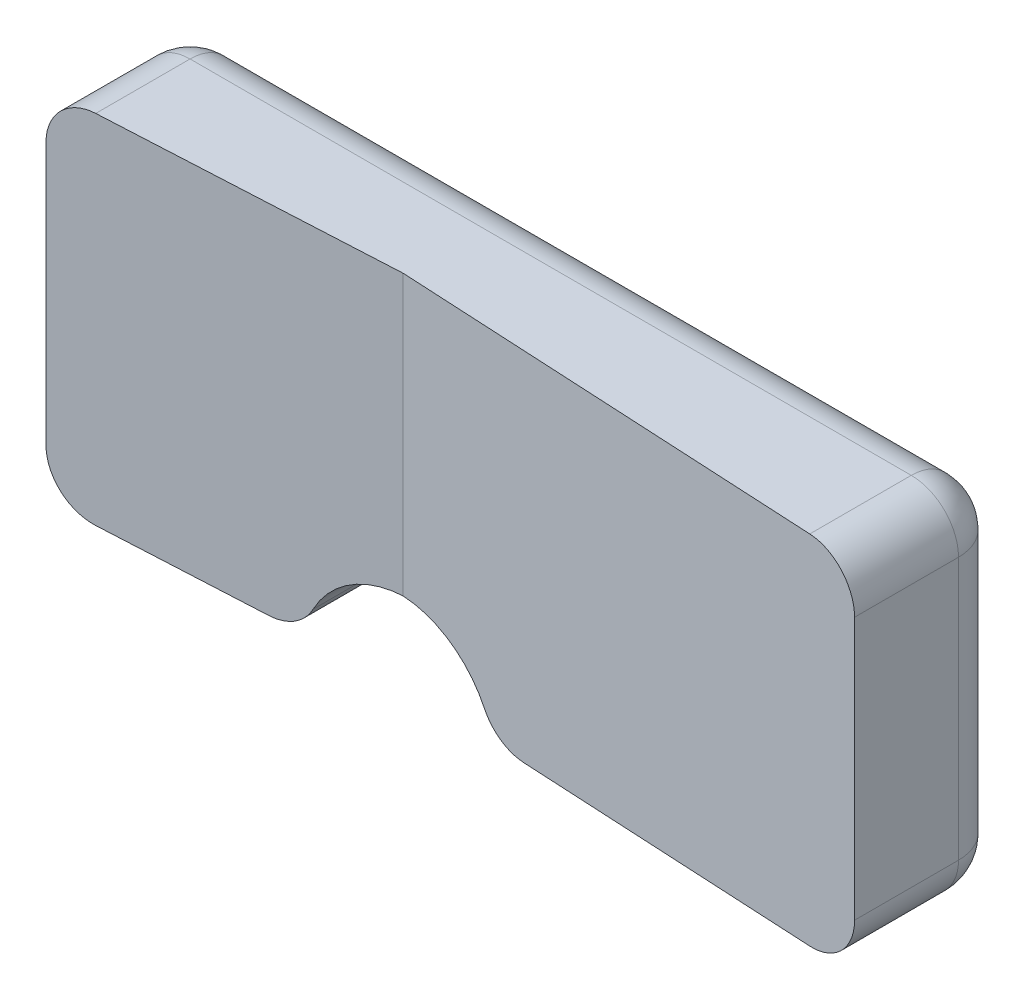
ISO-10303-21;
HEADER;
FILE_DESCRIPTION(('STEP AP214'),'2;1');
FILE_NAME('part.step','',(''),(''),'','','');
FILE_SCHEMA(('AUTOMOTIVE_DESIGN { 1 0 10303 214 1 1 1 1 }'));
ENDSEC;
DATA;
#1=APPLICATION_CONTEXT('core data for automotive mechanical design processes');
#2=APPLICATION_PROTOCOL_DEFINITION('international standard','automotive_design',2000,#1);
#3=PRODUCT_CONTEXT('',#1,'mechanical');
#4=PRODUCT('Part','Part','',(#3));
#5=PRODUCT_RELATED_PRODUCT_CATEGORY('part','',(#4));
#6=PRODUCT_DEFINITION_FORMATION('','',#4);
#7=PRODUCT_DEFINITION_CONTEXT('part definition',#1,'design');
#8=PRODUCT_DEFINITION('design','',#6,#7);
#9=PRODUCT_DEFINITION_SHAPE('','',#8);
#10=(LENGTH_UNIT() NAMED_UNIT(*) SI_UNIT(.MILLI.,.METRE.));
#11=(NAMED_UNIT(*) PLANE_ANGLE_UNIT() SI_UNIT($,.RADIAN.));
#12=(NAMED_UNIT(*) SI_UNIT($,.STERADIAN.) SOLID_ANGLE_UNIT());
#13=UNCERTAINTY_MEASURE_WITH_UNIT(LENGTH_MEASURE(1.E-05),#10,'distance_accuracy_value','');
#14=(GEOMETRIC_REPRESENTATION_CONTEXT(3) GLOBAL_UNCERTAINTY_ASSIGNED_CONTEXT((#13)) GLOBAL_UNIT_ASSIGNED_CONTEXT((#10,
#11,#12)) REPRESENTATION_CONTEXT('',''));
#15=CARTESIAN_POINT('',(0.,0.,0.));
#16=DIRECTION('',(0.,0.,1.));
#17=DIRECTION('',(1.,0.,0.));
#18=AXIS2_PLACEMENT_3D('',#15,#16,#17);
#19=CARTESIAN_POINT('',(-57.,-34.544,19.05));
#20=DIRECTION('',(0.,1.,0.));
#21=DIRECTION('',(0.,0.,1.));
#22=AXIS2_PLACEMENT_3D('',#19,#20,#21);
#23=PLANE('',#22);
#24=DIRECTION('',(-0.998629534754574,0.,-0.0523359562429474));
#25=VECTOR('',#24,1.);
#26=CARTESIAN_POINT('',(-56.4339853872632,-34.544,8.24979780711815));
#27=LINE('',#26,#25);
#28=CARTESIAN_POINT('',(72.0625,-34.544,14.9840132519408));
#29=VERTEX_POINT('',#28);
#30=CARTESIAN_POINT('',(21.4100107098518,-34.544,12.329428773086));
#31=VERTEX_POINT('',#30);
#32=EDGE_CURVE('E174',#29,#31,#27,.T.);
#33=ORIENTED_EDGE('',*,*,#32,.T.);
#34=DIRECTION('',(0.,0.,-1.));
#35=VECTOR('',#34,1.);
#36=CARTESIAN_POINT('',(21.4100107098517,-34.544,19.05));
#37=LINE('',#36,#35);
#38=CARTESIAN_POINT('',(21.4100107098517,-34.544,-2.0625));
#39=VERTEX_POINT('',#38);
#40=EDGE_CURVE('E218',#31,#39,#37,.T.);
#41=ORIENTED_EDGE('',*,*,#40,.T.);
#42=DIRECTION('',(1.,0.,0.));
#43=VECTOR('',#42,1.);
#44=CARTESIAN_POINT('',(-57.,-34.544,-2.0625));
#45=LINE('',#44,#43);
#46=CARTESIAN_POINT('',(72.0625,-34.544,-2.0625));
#47=VERTEX_POINT('',#46);
#48=EDGE_CURVE('E216',#39,#47,#45,.T.);
#49=ORIENTED_EDGE('',*,*,#48,.T.);
#50=DIRECTION('',(0.,0.,-1.));
#51=VECTOR('',#50,1.);
#52=CARTESIAN_POINT('',(72.0625,-34.544,19.05));
#53=LINE('',#52,#51);
#54=EDGE_CURVE('E214',#47,#29,#53,.F.);
#55=ORIENTED_EDGE('',*,*,#54,.T.);
#56=EDGE_LOOP('',(#33,#41,#49,#55));
#57=FACE_BOUND('',#56,.T.);
#58=ADVANCED_FACE('F34',(#57),#23,.F.);
#59=CARTESIAN_POINT('',(-57.,25.4,19.05));
#60=DIRECTION('',(1.,0.,0.));
#61=DIRECTION('',(0.,1.,0.));
#62=AXIS2_PLACEMENT_3D('',#59,#60,#61);
#63=PLANE('',#62);
#64=DIRECTION('',(0.,-1.,0.));
#65=VECTOR('',#64,1.);
#66=CARTESIAN_POINT('',(-57.,25.4,-2.0625));
#67=LINE('',#66,#65);
#68=CARTESIAN_POINT('',(-57.,17.4625,-2.0625));
#69=VERTEX_POINT('',#68);
#70=CARTESIAN_POINT('',(-57.,-26.6065,-2.0625));
#71=VERTEX_POINT('',#70);
#72=EDGE_CURVE('E228',#69,#71,#67,.T.);
#73=ORIENTED_EDGE('',*,*,#72,.T.);
#74=DIRECTION('',(0.,0.,-1.));
#75=VECTOR('',#74,1.);
#76=CARTESIAN_POINT('',(-57.,-26.6065,19.05));
#77=LINE('',#76,#75);
#78=CARTESIAN_POINT('',(-57.,-26.6065,14.1946210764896));
#79=VERTEX_POINT('',#78);
#80=EDGE_CURVE('E230',#71,#79,#77,.F.);
#81=ORIENTED_EDGE('',*,*,#80,.T.);
#82=DIRECTION('',(0.,1.,0.));
#83=VECTOR('',#82,1.);
#84=CARTESIAN_POINT('',(-57.,-83.058,14.1946210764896));
#85=LINE('',#84,#83);
#86=CARTESIAN_POINT('',(-57.,17.4625,14.1946210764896));
#87=VERTEX_POINT('',#86);
#88=EDGE_CURVE('E170',#79,#87,#85,.T.);
#89=ORIENTED_EDGE('',*,*,#88,.T.);
#90=DIRECTION('',(0.,0.,-1.));
#91=VECTOR('',#90,1.);
#92=CARTESIAN_POINT('',(-57.,17.4625,19.05));
#93=LINE('',#92,#91);
#94=EDGE_CURVE('E226',#87,#69,#93,.T.);
#95=ORIENTED_EDGE('',*,*,#94,.T.);
#96=EDGE_LOOP('',(#73,#81,#89,#95));
#97=FACE_BOUND('',#96,.T.);
#98=ADVANCED_FACE('F36',(#97),#63,.F.);
#99=DIRECTION('',(1.,0.,0.));
#100=VECTOR('',#99,1.);
#101=CARTESIAN_POINT('',(-57.,-34.544,-2.0625));
#102=LINE('',#101,#100);
#103=CARTESIAN_POINT('',(-49.0625,-34.544,-2.0625));
#104=VERTEX_POINT('',#103);
#105=CARTESIAN_POINT('',(-21.4100107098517,-34.544,-2.0625));
#106=VERTEX_POINT('',#105);
#107=EDGE_CURVE('E190',#104,#106,#102,.T.);
#108=ORIENTED_EDGE('',*,*,#107,.T.);
#109=DIRECTION('',(0.,0.,-1.));
#110=VECTOR('',#109,1.);
#111=CARTESIAN_POINT('',(-21.4100107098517,-34.544,19.05));
#112=LINE('',#111,#110);
#113=CARTESIAN_POINT('',(-21.4100107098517,-34.544,12.3294287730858));
#114=VERTEX_POINT('',#113);
#115=EDGE_CURVE('E194',#106,#114,#112,.F.);
#116=ORIENTED_EDGE('',*,*,#115,.T.);
#117=DIRECTION('',(-0.998629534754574,0.,0.0523359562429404));
#118=VECTOR('',#117,1.);
#119=CARTESIAN_POINT('',(-57.2537626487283,-34.544,14.2079202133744));
#120=LINE('',#119,#118);
#121=CARTESIAN_POINT('',(-49.0625,-34.544,13.7786343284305));
#122=VERTEX_POINT('',#121);
#123=EDGE_CURVE('E166',#114,#122,#120,.T.);
#124=ORIENTED_EDGE('',*,*,#123,.T.);
#125=DIRECTION('',(0.,0.,-1.));
#126=VECTOR('',#125,1.);
#127=CARTESIAN_POINT('',(-49.0625,-34.544,19.05));
#128=LINE('',#127,#126);
#129=EDGE_CURVE('E192',#122,#104,#128,.T.);
#130=ORIENTED_EDGE('',*,*,#129,.T.);
#131=EDGE_LOOP('',(#108,#116,#124,#130));
#132=FACE_BOUND('',#131,.T.);
#133=ADVANCED_FACE('F376',(#132),#23,.F.);
#134=CARTESIAN_POINT('',(80.,25.4,19.05));
#135=DIRECTION('',(-1.,0.,0.));
#136=DIRECTION('',(0.,-1.,0.));
#137=AXIS2_PLACEMENT_3D('',#134,#135,#136);
#138=PLANE('',#137);
#139=DIRECTION('',(0.,1.,0.));
#140=VECTOR('',#139,1.);
#141=CARTESIAN_POINT('',(80.,-83.058,15.4));
#142=LINE('',#141,#140);
#143=CARTESIAN_POINT('',(80.,-26.6065,15.4));
#144=VERTEX_POINT('',#143);
#145=CARTESIAN_POINT('',(80.,17.4625,15.4));
#146=VERTEX_POINT('',#145);
#147=EDGE_CURVE('E171',#144,#146,#142,.T.);
#148=ORIENTED_EDGE('',*,*,#147,.F.);
#149=DIRECTION('',(0.,0.,-1.));
#150=VECTOR('',#149,1.);
#151=CARTESIAN_POINT('',(80.,-26.6065,19.05));
#152=LINE('',#151,#150);
#153=CARTESIAN_POINT('',(80.,-26.6065,-2.0625));
#154=VERTEX_POINT('',#153);
#155=EDGE_CURVE('E11',#144,#154,#152,.T.);
#156=ORIENTED_EDGE('',*,*,#155,.T.);
#157=DIRECTION('',(0.,1.,0.));
#158=VECTOR('',#157,1.);
#159=CARTESIAN_POINT('',(80.,25.4,-2.0625));
#160=LINE('',#159,#158);
#161=CARTESIAN_POINT('',(80.,17.4625,-2.0625));
#162=VERTEX_POINT('',#161);
#163=EDGE_CURVE('E42',#154,#162,#160,.T.);
#164=ORIENTED_EDGE('',*,*,#163,.T.);
#165=DIRECTION('',(0.,0.,-1.));
#166=VECTOR('',#165,1.);
#167=CARTESIAN_POINT('',(80.,17.4625,19.05));
#168=LINE('',#167,#166);
#169=EDGE_CURVE('E238',#162,#146,#168,.F.);
#170=ORIENTED_EDGE('',*,*,#169,.T.);
#171=EDGE_LOOP('',(#148,#156,#164,#170));
#172=FACE_BOUND('',#171,.T.);
#173=ADVANCED_FACE('F239',(#172),#138,.F.);
#174=CARTESIAN_POINT('',(-57.,25.4,19.05));
#175=DIRECTION('',(0.,-1.,0.));
#176=DIRECTION('',(0.,0.,-1.));
#177=AXIS2_PLACEMENT_3D('',#174,#175,#176);
#178=PLANE('',#177);
#179=DIRECTION('',(-1.,0.,0.));
#180=VECTOR('',#179,1.);
#181=CARTESIAN_POINT('',(-57.,25.4,-2.0625));
#182=LINE('',#181,#180);
#183=CARTESIAN_POINT('',(72.0625,25.4,-2.0625));
#184=VERTEX_POINT('',#183);
#185=CARTESIAN_POINT('',(-49.0625,25.4,-2.0625));
#186=VERTEX_POINT('',#185);
#187=EDGE_CURVE('E234',#184,#186,#182,.T.);
#188=ORIENTED_EDGE('',*,*,#187,.T.);
#189=DIRECTION('',(0.,0.,-1.));
#190=VECTOR('',#189,1.);
#191=CARTESIAN_POINT('',(-49.0625,25.4,19.05));
#192=LINE('',#191,#190);
#193=CARTESIAN_POINT('',(-49.0625,25.4,13.7786343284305));
#194=VERTEX_POINT('',#193);
#195=EDGE_CURVE('E236',#186,#194,#192,.F.);
#196=ORIENTED_EDGE('',*,*,#195,.T.);
#197=DIRECTION('',(-0.998629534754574,0.,0.0523359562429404));
#198=VECTOR('',#197,1.);
#199=CARTESIAN_POINT('',(0.,25.4,11.2073776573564));
#200=LINE('',#199,#198);
#201=CARTESIAN_POINT('',(0.,25.4,11.2073776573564));
#202=VERTEX_POINT('',#201);
#203=EDGE_CURVE('E177',#202,#194,#200,.T.);
#204=ORIENTED_EDGE('',*,*,#203,.F.);
#205=DIRECTION('',(-0.998629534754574,0.,-0.0523359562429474));
#206=VECTOR('',#205,1.);
#207=CARTESIAN_POINT('',(80.,25.4,15.4));
#208=LINE('',#207,#206);
#209=CARTESIAN_POINT('',(72.0625,25.4,14.9840132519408));
#210=VERTEX_POINT('',#209);
#211=EDGE_CURVE('E156',#210,#202,#208,.T.);
#212=ORIENTED_EDGE('',*,*,#211,.F.);
#213=DIRECTION('',(0.,0.,-1.));
#214=VECTOR('',#213,1.);
#215=CARTESIAN_POINT('',(72.0625,25.4,19.05));
#216=LINE('',#215,#214);
#217=EDGE_CURVE('E232',#210,#184,#216,.T.);
#218=ORIENTED_EDGE('',*,*,#217,.T.);
#219=EDGE_LOOP('',(#188,#196,#204,#212,#218));
#220=FACE_BOUND('',#219,.T.);
#221=ADVANCED_FACE('F250',(#220),#178,.F.);
#222=CARTESIAN_POINT('',(-57.,-34.544,-10.));
#223=DIRECTION('',(0.,0.,1.));
#224=DIRECTION('',(1.,0.,0.));
#225=AXIS2_PLACEMENT_3D('',#222,#223,#224);
#226=PLANE('',#225);
#227=DIRECTION('',(1.,0.,0.));
#228=VECTOR('',#227,1.);
#229=CARTESIAN_POINT('',(-57.,-26.6065,-10.));
#230=LINE('',#229,#228);
#231=CARTESIAN_POINT('',(72.0625,-26.6065,-10.));
#232=VERTEX_POINT('',#231);
#233=CARTESIAN_POINT('',(21.4100107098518,-26.6065,-10.));
#234=VERTEX_POINT('',#233);
#235=EDGE_CURVE('E203',#232,#234,#230,.F.);
#236=ORIENTED_EDGE('',*,*,#235,.T.);
#237=CARTESIAN_POINT('',(0.,-37.7370707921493,-10.));
#238=DIRECTION('',(0.,0.,1.));
#239=DIRECTION('',(1.,0.,0.));
#240=AXIS2_PLACEMENT_3D('',#237,#238,#239);
#241=CIRCLE('',#240,24.1304406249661);
#242=CARTESIAN_POINT('',(-21.4100107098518,-26.6065,-10.));
#243=VERTEX_POINT('',#242);
#244=EDGE_CURVE('E211',#234,#243,#241,.T.);
#245=ORIENTED_EDGE('',*,*,#244,.T.);
#246=DIRECTION('',(1.,0.,0.));
#247=VECTOR('',#246,1.);
#248=CARTESIAN_POINT('',(-57.,-26.6065,-10.));
#249=LINE('',#248,#247);
#250=CARTESIAN_POINT('',(-49.0625,-26.6065,-10.));
#251=VERTEX_POINT('',#250);
#252=EDGE_CURVE('E209',#243,#251,#249,.F.);
#253=ORIENTED_EDGE('',*,*,#252,.T.);
#254=DIRECTION('',(0.,-1.,0.));
#255=VECTOR('',#254,1.);
#256=CARTESIAN_POINT('',(-49.0625,-34.544,-10.));
#257=LINE('',#256,#255);
#258=CARTESIAN_POINT('',(-49.0625,17.4625,-10.));
#259=VERTEX_POINT('',#258);
#260=EDGE_CURVE('E207',#251,#259,#257,.F.);
#261=ORIENTED_EDGE('',*,*,#260,.T.);
#262=DIRECTION('',(-1.,0.,0.));
#263=VECTOR('',#262,1.);
#264=CARTESIAN_POINT('',(-57.,17.4625,-10.));
#265=LINE('',#264,#263);
#266=CARTESIAN_POINT('',(72.0625,17.4625,-10.));
#267=VERTEX_POINT('',#266);
#268=EDGE_CURVE('E205',#259,#267,#265,.F.);
#269=ORIENTED_EDGE('',*,*,#268,.T.);
#270=DIRECTION('',(0.,1.,0.));
#271=VECTOR('',#270,1.);
#272=CARTESIAN_POINT('',(72.0625,-34.5440000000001,-10.));
#273=LINE('',#272,#271);
#274=EDGE_CURVE('E201',#267,#232,#273,.F.);
#275=ORIENTED_EDGE('',*,*,#274,.T.);
#276=EDGE_LOOP('',(#236,#245,#253,#261,#269,#275));
#277=FACE_BOUND('',#276,.T.);
#278=ADVANCED_FACE('F409',(#277),#226,.F.);
#279=CARTESIAN_POINT('',(0.,-83.058,11.2073776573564));
#280=DIRECTION('',(-0.0523359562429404,0.,-0.998629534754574));
#281=DIRECTION('',(-0.998629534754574,0.,0.0523359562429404));
#282=AXIS2_PLACEMENT_3D('',#279,#280,#281);
#283=PLANE('',#282);
#284=ORIENTED_EDGE('',*,*,#123,.F.);
#285=CARTESIAN_POINT('',(-21.4100107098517,-26.6065,12.3294287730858));
#286=DIRECTION('',(-0.0523359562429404,0.,-0.998629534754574));
#287=DIRECTION('',(0.998629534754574,0.,-0.0523359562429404));
#288=AXIS2_PLACEMENT_3D('',#285,#286,#287);
#289=ELLIPSE('',#288,7.9483929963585,7.9375);
#290=CARTESIAN_POINT('',(-14.3673726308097,-30.2678051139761,11.960339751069));
#291=VERTEX_POINT('',#290);
#292=EDGE_CURVE('E152',#114,#291,#289,.F.);
#293=ORIENTED_EDGE('',*,*,#292,.T.);
#294=CARTESIAN_POINT('',(0.,-37.7370707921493,11.2073776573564));
#295=DIRECTION('',(-0.0523359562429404,0.,-0.998629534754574));
#296=DIRECTION('',(0.998629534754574,0.,-0.0523359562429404));
#297=AXIS2_PLACEMENT_3D('',#294,#295,#296);
#298=ELLIPSE('',#297,16.2151629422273,16.1929406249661);
#299=CARTESIAN_POINT('',(0.,-21.5441301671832,11.2073776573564));
#300=VERTEX_POINT('',#299);
#301=EDGE_CURVE('E143',#291,#300,#298,.T.);
#302=ORIENTED_EDGE('',*,*,#301,.T.);
#303=DIRECTION('',(0.,1.,0.));
#304=VECTOR('',#303,1.);
#305=CARTESIAN_POINT('',(0.,-83.058,11.2073776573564));
#306=LINE('',#305,#304);
#307=EDGE_CURVE('E149',#300,#202,#306,.T.);
#308=ORIENTED_EDGE('',*,*,#307,.T.);
#309=ORIENTED_EDGE('',*,*,#203,.T.);
#310=CARTESIAN_POINT('',(-49.0625,17.4625,13.7786343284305));
#311=DIRECTION('',(-0.0523359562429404,0.,-0.998629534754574));
#312=DIRECTION('',(0.998629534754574,0.,-0.0523359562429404));
#313=AXIS2_PLACEMENT_3D('',#310,#311,#312);
#314=ELLIPSE('',#313,7.9483929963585,7.9375);
#315=EDGE_CURVE('E196',#194,#87,#314,.F.);
#316=ORIENTED_EDGE('',*,*,#315,.T.);
#317=ORIENTED_EDGE('',*,*,#88,.F.);
#318=CARTESIAN_POINT('',(-49.0625,-26.6065,13.7786343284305));
#319=DIRECTION('',(-0.0523359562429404,0.,-0.998629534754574));
#320=DIRECTION('',(0.998629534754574,0.,-0.0523359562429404));
#321=AXIS2_PLACEMENT_3D('',#318,#319,#320);
#322=ELLIPSE('',#321,7.9483929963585,7.9375);
#323=EDGE_CURVE('E198',#79,#122,#322,.F.);
#324=ORIENTED_EDGE('',*,*,#323,.T.);
#325=EDGE_LOOP('',(#284,#293,#302,#308,#309,#316,#317,#324));
#326=FACE_BOUND('',#325,.T.);
#327=ADVANCED_FACE('F146',(#326),#283,.F.);
#328=CARTESIAN_POINT('',(80.,-83.058,15.4));
#329=DIRECTION('',(0.0523359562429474,0.,-0.998629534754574));
#330=DIRECTION('',(-0.998629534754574,0.,-0.0523359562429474));
#331=AXIS2_PLACEMENT_3D('',#328,#329,#330);
#332=PLANE('',#331);
#333=CARTESIAN_POINT('',(0.,-37.7370707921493,11.2073776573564));
#334=DIRECTION('',(0.0523359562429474,0.,-0.998629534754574));
#335=DIRECTION('',(-0.998629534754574,0.,-0.0523359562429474));
#336=AXIS2_PLACEMENT_3D('',#333,#334,#335);
#337=ELLIPSE('',#336,16.2151629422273,16.1929406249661);
#338=CARTESIAN_POINT('',(14.3673726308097,-30.2678051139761,11.9603397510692));
#339=VERTEX_POINT('',#338);
#340=EDGE_CURVE('E160',#300,#339,#337,.T.);
#341=ORIENTED_EDGE('',*,*,#340,.T.);
#342=CARTESIAN_POINT('',(21.4100107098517,-26.6065,12.329428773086));
#343=DIRECTION('',(0.0523359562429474,0.,-0.998629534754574));
#344=DIRECTION('',(-0.998629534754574,0.,-0.0523359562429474));
#345=AXIS2_PLACEMENT_3D('',#342,#343,#344);
#346=ELLIPSE('',#345,7.9483929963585,7.9375);
#347=EDGE_CURVE('E224',#339,#31,#346,.F.);
#348=ORIENTED_EDGE('',*,*,#347,.T.);
#349=ORIENTED_EDGE('',*,*,#32,.F.);
#350=CARTESIAN_POINT('',(72.0625,-26.6065,14.9840132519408));
#351=DIRECTION('',(0.0523359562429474,0.,-0.998629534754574));
#352=DIRECTION('',(-0.998629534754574,0.,-0.0523359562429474));
#353=AXIS2_PLACEMENT_3D('',#350,#351,#352);
#354=ELLIPSE('',#353,7.9483929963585,7.9375);
#355=EDGE_CURVE('E222',#29,#144,#354,.F.);
#356=ORIENTED_EDGE('',*,*,#355,.T.);
#357=ORIENTED_EDGE('',*,*,#147,.T.);
#358=CARTESIAN_POINT('',(72.0625,17.4625,14.9840132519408));
#359=DIRECTION('',(0.0523359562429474,0.,-0.998629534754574));
#360=DIRECTION('',(-0.998629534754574,0.,-0.0523359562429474));
#361=AXIS2_PLACEMENT_3D('',#358,#359,#360);
#362=ELLIPSE('',#361,7.9483929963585,7.9375);
#363=EDGE_CURVE('E220',#146,#210,#362,.F.);
#364=ORIENTED_EDGE('',*,*,#363,.T.);
#365=ORIENTED_EDGE('',*,*,#211,.T.);
#366=ORIENTED_EDGE('',*,*,#307,.F.);
#367=EDGE_LOOP('',(#341,#348,#349,#356,#357,#364,#365,#366));
#368=FACE_BOUND('',#367,.T.);
#369=ADVANCED_FACE('F168',(#368),#332,.F.);
#370=CARTESIAN_POINT('',(0.,-37.7370707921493,15.641058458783));
#371=DIRECTION('',(0.,0.,-1.));
#372=DIRECTION('',(-1.,0.,0.));
#373=AXIS2_PLACEMENT_3D('',#370,#371,#372);
#374=CYLINDRICAL_SURFACE('',#373,16.1929406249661);
#375=ORIENTED_EDGE('',*,*,#301,.F.);
#376=DIRECTION('',(0.,0.,-1.));
#377=VECTOR('',#376,1.);
#378=CARTESIAN_POINT('',(-14.3673726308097,-30.2678051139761,15.641058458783));
#379=LINE('',#378,#377);
#380=CARTESIAN_POINT('',(-14.3673726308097,-30.2678051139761,-2.0625));
#381=VERTEX_POINT('',#380);
#382=EDGE_CURVE('E188',#291,#381,#379,.T.);
#383=ORIENTED_EDGE('',*,*,#382,.T.);
#384=CARTESIAN_POINT('',(0.,-37.7370707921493,-2.0625));
#385=DIRECTION('',(0.,0.,1.));
#386=DIRECTION('',(1.,0.,0.));
#387=AXIS2_PLACEMENT_3D('',#384,#385,#386);
#388=CIRCLE('',#387,16.1929406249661);
#389=CARTESIAN_POINT('',(14.3673726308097,-30.2678051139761,-2.0625));
#390=VERTEX_POINT('',#389);
#391=EDGE_CURVE('E186',#381,#390,#388,.F.);
#392=ORIENTED_EDGE('',*,*,#391,.T.);
#393=DIRECTION('',(0.,0.,-1.));
#394=VECTOR('',#393,1.);
#395=CARTESIAN_POINT('',(14.3673726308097,-30.2678051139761,15.641058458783));
#396=LINE('',#395,#394);
#397=EDGE_CURVE('E163',#390,#339,#396,.F.);
#398=ORIENTED_EDGE('',*,*,#397,.T.);
#399=ORIENTED_EDGE('',*,*,#340,.F.);
#400=EDGE_LOOP('',(#375,#383,#392,#398,#399));
#401=FACE_BOUND('',#400,.T.);
#402=ADVANCED_FACE('F161',(#401),#374,.F.);
#403=CARTESIAN_POINT('',(72.0625,17.4625,19.05));
#404=DIRECTION('',(0.,0.,-1.));
#405=DIRECTION('',(-1.,0.,0.));
#406=AXIS2_PLACEMENT_3D('',#403,#404,#405);
#407=CYLINDRICAL_SURFACE('',#406,7.9375);
#408=CARTESIAN_POINT('',(72.0625,17.4625,-2.0625));
#409=DIRECTION('',(0.,0.,-1.));
#410=DIRECTION('',(-1.,0.,0.));
#411=AXIS2_PLACEMENT_3D('',#408,#409,#410);
#412=CIRCLE('',#411,7.9375);
#413=EDGE_CURVE('E157',#184,#162,#412,.T.);
#414=ORIENTED_EDGE('',*,*,#413,.F.);
#415=ORIENTED_EDGE('',*,*,#217,.F.);
#416=ORIENTED_EDGE('',*,*,#363,.F.);
#417=ORIENTED_EDGE('',*,*,#169,.F.);
#418=EDGE_LOOP('',(#414,#415,#416,#417));
#419=FACE_BOUND('',#418,.T.);
#420=ADVANCED_FACE('F247',(#419),#407,.T.);
#421=CARTESIAN_POINT('',(72.0625,17.4625,-2.0625));
#422=DIRECTION('',(0.,0.,1.));
#423=DIRECTION('',(1.,0.,0.));
#424=AXIS2_PLACEMENT_3D('',#421,#422,#423);
#425=SPHERICAL_SURFACE('',#424,7.9375);
#426=CARTESIAN_POINT('',(72.0625,17.4625,-2.0625));
#427=DIRECTION('',(1.,0.,0.));
#428=DIRECTION('',(0.,1.,0.));
#429=AXIS2_PLACEMENT_3D('',#426,#427,#428);
#430=CIRCLE('',#429,7.9375);
#431=EDGE_CURVE('E259',#184,#267,#430,.F.);
#432=ORIENTED_EDGE('',*,*,#431,.F.);
#433=ORIENTED_EDGE('',*,*,#413,.T.);
#434=CARTESIAN_POINT('',(72.0625,17.4625,-2.0625));
#435=DIRECTION('',(0.,1.,0.));
#436=DIRECTION('',(-1.,0.,0.));
#437=AXIS2_PLACEMENT_3D('',#434,#435,#436);
#438=CIRCLE('',#437,7.9375);
#439=EDGE_CURVE('E256',#267,#162,#438,.F.);
#440=ORIENTED_EDGE('',*,*,#439,.F.);
#441=EDGE_LOOP('',(#432,#433,#440));
#442=FACE_BOUND('',#441,.T.);
#443=ADVANCED_FACE('F343',(#442),#425,.T.);
#444=CARTESIAN_POINT('',(72.0625,-26.6065,19.05));
#445=DIRECTION('',(0.,0.,-1.));
#446=DIRECTION('',(-1.,0.,0.));
#447=AXIS2_PLACEMENT_3D('',#444,#445,#446);
#448=CYLINDRICAL_SURFACE('',#447,7.9375);
#449=ORIENTED_EDGE('',*,*,#355,.F.);
#450=ORIENTED_EDGE('',*,*,#54,.F.);
#451=CARTESIAN_POINT('',(72.0625,-26.6065,-2.0625));
#452=DIRECTION('',(0.,0.,-1.));
#453=DIRECTION('',(-1.,0.,0.));
#454=AXIS2_PLACEMENT_3D('',#451,#452,#453);
#455=CIRCLE('',#454,7.9375);
#456=EDGE_CURVE('E262',#154,#47,#455,.T.);
#457=ORIENTED_EDGE('',*,*,#456,.F.);
#458=ORIENTED_EDGE('',*,*,#155,.F.);
#459=EDGE_LOOP('',(#449,#450,#457,#458));
#460=FACE_BOUND('',#459,.T.);
#461=ADVANCED_FACE('F334',(#460),#448,.T.);
#462=CARTESIAN_POINT('',(72.0625,25.4,-2.0625));
#463=DIRECTION('',(0.,1.,0.));
#464=DIRECTION('',(-1.,0.,0.));
#465=AXIS2_PLACEMENT_3D('',#462,#463,#464);
#466=CYLINDRICAL_SURFACE('',#465,7.9375);
#467=ORIENTED_EDGE('',*,*,#439,.T.);
#468=ORIENTED_EDGE('',*,*,#163,.F.);
#469=CARTESIAN_POINT('',(72.0625,-26.6065,-2.0625));
#470=DIRECTION('',(0.,-1.,0.));
#471=DIRECTION('',(0.,0.,-1.));
#472=AXIS2_PLACEMENT_3D('',#469,#470,#471);
#473=CIRCLE('',#472,7.9375);
#474=EDGE_CURVE('E265',#232,#154,#473,.T.);
#475=ORIENTED_EDGE('',*,*,#474,.F.);
#476=ORIENTED_EDGE('',*,*,#274,.F.);
#477=EDGE_LOOP('',(#467,#468,#475,#476));
#478=FACE_BOUND('',#477,.T.);
#479=ADVANCED_FACE('F340',(#478),#466,.T.);
#480=CARTESIAN_POINT('',(-57.,17.4625,-2.0625));
#481=DIRECTION('',(-1.,0.,0.));
#482=DIRECTION('',(0.,0.,1.));
#483=AXIS2_PLACEMENT_3D('',#480,#481,#482);
#484=CYLINDRICAL_SURFACE('',#483,7.9375);
#485=ORIENTED_EDGE('',*,*,#431,.T.);
#486=ORIENTED_EDGE('',*,*,#268,.F.);
#487=CARTESIAN_POINT('',(-49.0625,17.4625,-2.0625));
#488=DIRECTION('',(-1.,0.,0.));
#489=DIRECTION('',(0.,0.,1.));
#490=AXIS2_PLACEMENT_3D('',#487,#488,#489);
#491=CIRCLE('',#490,7.9375);
#492=EDGE_CURVE('E268',#186,#259,#491,.T.);
#493=ORIENTED_EDGE('',*,*,#492,.F.);
#494=ORIENTED_EDGE('',*,*,#187,.F.);
#495=EDGE_LOOP('',(#485,#486,#493,#494));
#496=FACE_BOUND('',#495,.T.);
#497=ADVANCED_FACE('F347',(#496),#484,.T.);
#498=CARTESIAN_POINT('',(-49.0625,17.4625,19.05));
#499=DIRECTION('',(0.,0.,-1.));
#500=DIRECTION('',(-1.,0.,0.));
#501=AXIS2_PLACEMENT_3D('',#498,#499,#500);
#502=CYLINDRICAL_SURFACE('',#501,7.9375);
#503=ORIENTED_EDGE('',*,*,#315,.F.);
#504=ORIENTED_EDGE('',*,*,#195,.F.);
#505=CARTESIAN_POINT('',(-49.0625,17.4625,-2.0625));
#506=DIRECTION('',(0.,0.,-1.));
#507=DIRECTION('',(-1.,0.,0.));
#508=AXIS2_PLACEMENT_3D('',#505,#506,#507);
#509=CIRCLE('',#508,7.9375);
#510=EDGE_CURVE('E271',#69,#186,#509,.T.);
#511=ORIENTED_EDGE('',*,*,#510,.F.);
#512=ORIENTED_EDGE('',*,*,#94,.F.);
#513=EDGE_LOOP('',(#503,#504,#511,#512));
#514=FACE_BOUND('',#513,.T.);
#515=ADVANCED_FACE('F356',(#514),#502,.T.);
#516=CARTESIAN_POINT('',(72.0625,-26.6065,-2.0625));
#517=DIRECTION('',(0.,0.,1.));
#518=DIRECTION('',(1.,0.,0.));
#519=AXIS2_PLACEMENT_3D('',#516,#517,#518);
#520=SPHERICAL_SURFACE('',#519,7.9375);
#521=ORIENTED_EDGE('',*,*,#474,.T.);
#522=ORIENTED_EDGE('',*,*,#456,.T.);
#523=CARTESIAN_POINT('',(72.0625,-26.6065,-2.0625));
#524=DIRECTION('',(1.,0.,0.));
#525=DIRECTION('',(0.,0.,-1.));
#526=AXIS2_PLACEMENT_3D('',#523,#524,#525);
#527=CIRCLE('',#526,7.9375);
#528=EDGE_CURVE('E274',#232,#47,#527,.F.);
#529=ORIENTED_EDGE('',*,*,#528,.F.);
#530=EDGE_LOOP('',(#521,#522,#529));
#531=FACE_BOUND('',#530,.T.);
#532=ADVANCED_FACE('F336',(#531),#520,.T.);
#533=CARTESIAN_POINT('',(-49.0625,17.4625,-2.0625));
#534=DIRECTION('',(0.,0.,1.));
#535=DIRECTION('',(1.,0.,0.));
#536=AXIS2_PLACEMENT_3D('',#533,#534,#535);
#537=SPHERICAL_SURFACE('',#536,7.9375);
#538=ORIENTED_EDGE('',*,*,#510,.T.);
#539=ORIENTED_EDGE('',*,*,#492,.T.);
#540=CARTESIAN_POINT('',(-49.0625,17.4625,-2.0625));
#541=DIRECTION('',(0.,1.,0.));
#542=DIRECTION('',(-1.,0.,0.));
#543=AXIS2_PLACEMENT_3D('',#540,#541,#542);
#544=CIRCLE('',#543,7.9375);
#545=EDGE_CURVE('E277',#69,#259,#544,.F.);
#546=ORIENTED_EDGE('',*,*,#545,.F.);
#547=EDGE_LOOP('',(#538,#539,#546));
#548=FACE_BOUND('',#547,.T.);
#549=ADVANCED_FACE('F351',(#548),#537,.T.);
#550=CARTESIAN_POINT('',(21.4100107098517,-26.6065,15.641058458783));
#551=DIRECTION('',(0.,0.,-1.));
#552=DIRECTION('',(-1.,0.,0.));
#553=AXIS2_PLACEMENT_3D('',#550,#551,#552);
#554=CYLINDRICAL_SURFACE('',#553,7.9375);
#555=ORIENTED_EDGE('',*,*,#347,.F.);
#556=ORIENTED_EDGE('',*,*,#397,.F.);
#557=CARTESIAN_POINT('',(21.4100107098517,-26.6065,-2.0625));
#558=DIRECTION('',(0.,0.,-1.));
#559=DIRECTION('',(-1.,0.,0.));
#560=AXIS2_PLACEMENT_3D('',#557,#558,#559);
#561=CIRCLE('',#560,7.9375);
#562=EDGE_CURVE('E280',#39,#390,#561,.T.);
#563=ORIENTED_EDGE('',*,*,#562,.F.);
#564=ORIENTED_EDGE('',*,*,#40,.F.);
#565=EDGE_LOOP('',(#555,#556,#563,#564));
#566=FACE_BOUND('',#565,.T.);
#567=ADVANCED_FACE('F320',(#566),#554,.T.);
#568=CARTESIAN_POINT('',(-57.,-26.6065,-2.0625));
#569=DIRECTION('',(1.,0.,0.));
#570=DIRECTION('',(0.,0.,-1.));
#571=AXIS2_PLACEMENT_3D('',#568,#569,#570);
#572=CYLINDRICAL_SURFACE('',#571,7.9375);
#573=ORIENTED_EDGE('',*,*,#528,.T.);
#574=ORIENTED_EDGE('',*,*,#48,.F.);
#575=CARTESIAN_POINT('',(21.4100107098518,-26.6065,-2.0625));
#576=DIRECTION('',(-1.,0.,0.));
#577=DIRECTION('',(0.,-1.,0.));
#578=AXIS2_PLACEMENT_3D('',#575,#576,#577);
#579=CIRCLE('',#578,7.9375);
#580=EDGE_CURVE('E283',#234,#39,#579,.T.);
#581=ORIENTED_EDGE('',*,*,#580,.F.);
#582=ORIENTED_EDGE('',*,*,#235,.F.);
#583=EDGE_LOOP('',(#573,#574,#581,#582));
#584=FACE_BOUND('',#583,.T.);
#585=ADVANCED_FACE('F328',(#584),#572,.T.);
#586=CARTESIAN_POINT('',(-49.0625,25.4,-2.0625));
#587=DIRECTION('',(0.,-1.,0.));
#588=DIRECTION('',(1.,0.,0.));
#589=AXIS2_PLACEMENT_3D('',#586,#587,#588);
#590=CYLINDRICAL_SURFACE('',#589,7.9375);
#591=ORIENTED_EDGE('',*,*,#545,.T.);
#592=ORIENTED_EDGE('',*,*,#260,.F.);
#593=CARTESIAN_POINT('',(-49.0625,-26.6065,-2.0625));
#594=DIRECTION('',(0.,-1.,0.));
#595=DIRECTION('',(1.,0.,0.));
#596=AXIS2_PLACEMENT_3D('',#593,#594,#595);
#597=CIRCLE('',#596,7.9375);
#598=EDGE_CURVE('E286',#71,#251,#597,.T.);
#599=ORIENTED_EDGE('',*,*,#598,.F.);
#600=ORIENTED_EDGE('',*,*,#72,.F.);
#601=EDGE_LOOP('',(#591,#592,#599,#600));
#602=FACE_BOUND('',#601,.T.);
#603=ADVANCED_FACE('F369',(#602),#590,.T.);
#604=CARTESIAN_POINT('',(-49.0625,-26.6065,19.05));
#605=DIRECTION('',(0.,0.,-1.));
#606=DIRECTION('',(-1.,0.,0.));
#607=AXIS2_PLACEMENT_3D('',#604,#605,#606);
#608=CYLINDRICAL_SURFACE('',#607,7.9375);
#609=ORIENTED_EDGE('',*,*,#323,.F.);
#610=ORIENTED_EDGE('',*,*,#80,.F.);
#611=CARTESIAN_POINT('',(-49.0625,-26.6065,-2.0625));
#612=DIRECTION('',(0.,0.,-1.));
#613=DIRECTION('',(-1.,0.,0.));
#614=AXIS2_PLACEMENT_3D('',#611,#612,#613);
#615=CIRCLE('',#614,7.9375);
#616=EDGE_CURVE('E289',#104,#71,#615,.T.);
#617=ORIENTED_EDGE('',*,*,#616,.F.);
#618=ORIENTED_EDGE('',*,*,#129,.F.);
#619=EDGE_LOOP('',(#609,#610,#617,#618));
#620=FACE_BOUND('',#619,.T.);
#621=ADVANCED_FACE('F364',(#620),#608,.T.);
#622=CARTESIAN_POINT('',(21.4100107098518,-26.6065,-2.0625));
#623=DIRECTION('',(0.,0.,1.));
#624=DIRECTION('',(1.,0.,0.));
#625=AXIS2_PLACEMENT_3D('',#622,#623,#624);
#626=SPHERICAL_SURFACE('',#625,7.9375);
#627=ORIENTED_EDGE('',*,*,#580,.T.);
#628=ORIENTED_EDGE('',*,*,#562,.T.);
#629=CARTESIAN_POINT('',(21.4100107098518,-26.6065,-2.0625));
#630=DIRECTION('',(0.461266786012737,-0.887261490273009,0.));
#631=DIRECTION('',(0.887261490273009,0.461266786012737,0.));
#632=AXIS2_PLACEMENT_3D('',#629,#630,#631);
#633=CIRCLE('',#632,7.9375);
#634=EDGE_CURVE('E292',#234,#390,#633,.F.);
#635=ORIENTED_EDGE('',*,*,#634,.F.);
#636=EDGE_LOOP('',(#627,#628,#635));
#637=FACE_BOUND('',#636,.T.);
#638=ADVANCED_FACE('F323',(#637),#626,.T.);
#639=CARTESIAN_POINT('',(-49.0625,-26.6065,-2.0625));
#640=DIRECTION('',(0.,0.,1.));
#641=DIRECTION('',(1.,0.,0.));
#642=AXIS2_PLACEMENT_3D('',#639,#640,#641);
#643=SPHERICAL_SURFACE('',#642,7.9375);
#644=ORIENTED_EDGE('',*,*,#616,.T.);
#645=ORIENTED_EDGE('',*,*,#598,.T.);
#646=CARTESIAN_POINT('',(-49.0625,-26.6065,-2.0625));
#647=DIRECTION('',(-1.,0.,0.));
#648=DIRECTION('',(0.,-1.,0.));
#649=AXIS2_PLACEMENT_3D('',#646,#647,#648);
#650=CIRCLE('',#649,7.9375);
#651=EDGE_CURVE('E295',#104,#251,#650,.F.);
#652=ORIENTED_EDGE('',*,*,#651,.F.);
#653=EDGE_LOOP('',(#644,#645,#652));
#654=FACE_BOUND('',#653,.T.);
#655=ADVANCED_FACE('F371',(#654),#643,.T.);
#656=CARTESIAN_POINT('',(0.,-37.7370707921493,-2.0625));
#657=DIRECTION('',(0.,0.,1.));
#658=DIRECTION('',(1.,0.,0.));
#659=AXIS2_PLACEMENT_3D('',#656,#657,#658);
#660=TOROIDAL_SURFACE('',#659,24.1304406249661,7.9375);
#661=ORIENTED_EDGE('',*,*,#634,.T.);
#662=ORIENTED_EDGE('',*,*,#391,.F.);
#663=CARTESIAN_POINT('',(-21.4100107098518,-26.6065,-2.0625));
#664=DIRECTION('',(-0.461266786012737,-0.887261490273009,0.));
#665=DIRECTION('',(0.887261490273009,-0.461266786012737,0.));
#666=AXIS2_PLACEMENT_3D('',#663,#664,#665);
#667=CIRCLE('',#666,7.9375);
#668=EDGE_CURVE('E298',#243,#381,#667,.T.);
#669=ORIENTED_EDGE('',*,*,#668,.F.);
#670=ORIENTED_EDGE('',*,*,#244,.F.);
#671=EDGE_LOOP('',(#661,#662,#669,#670));
#672=FACE_BOUND('',#671,.T.);
#673=ADVANCED_FACE('F316',(#672),#660,.T.);
#674=CARTESIAN_POINT('',(-57.,-26.6065,-2.0625));
#675=DIRECTION('',(1.,0.,0.));
#676=DIRECTION('',(0.,0.,-1.));
#677=AXIS2_PLACEMENT_3D('',#674,#675,#676);
#678=CYLINDRICAL_SURFACE('',#677,7.9375);
#679=ORIENTED_EDGE('',*,*,#651,.T.);
#680=ORIENTED_EDGE('',*,*,#252,.F.);
#681=CARTESIAN_POINT('',(-21.4100107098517,-26.6065,-2.0625));
#682=DIRECTION('',(1.,0.,0.));
#683=DIRECTION('',(0.,0.,-1.));
#684=AXIS2_PLACEMENT_3D('',#681,#682,#683);
#685=CIRCLE('',#684,7.9375);
#686=EDGE_CURVE('E301',#106,#243,#685,.T.);
#687=ORIENTED_EDGE('',*,*,#686,.F.);
#688=ORIENTED_EDGE('',*,*,#107,.F.);
#689=EDGE_LOOP('',(#679,#680,#687,#688));
#690=FACE_BOUND('',#689,.T.);
#691=ADVANCED_FACE('F374',(#690),#678,.T.);
#692=CARTESIAN_POINT('',(-21.4100107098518,-26.6065,-2.0625));
#693=DIRECTION('',(0.,0.,1.));
#694=DIRECTION('',(1.,0.,0.));
#695=AXIS2_PLACEMENT_3D('',#692,#693,#694);
#696=SPHERICAL_SURFACE('',#695,7.9375);
#697=ORIENTED_EDGE('',*,*,#686,.T.);
#698=ORIENTED_EDGE('',*,*,#668,.T.);
#699=CARTESIAN_POINT('',(-21.4100107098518,-26.6065,-2.0625));
#700=DIRECTION('',(0.,0.,-1.));
#701=DIRECTION('',(0.,1.,0.));
#702=AXIS2_PLACEMENT_3D('',#699,#700,#701);
#703=CIRCLE('',#702,7.9375);
#704=EDGE_CURVE('E303',#106,#381,#703,.F.);
#705=ORIENTED_EDGE('',*,*,#704,.F.);
#706=EDGE_LOOP('',(#697,#698,#705));
#707=FACE_BOUND('',#706,.T.);
#708=ADVANCED_FACE('F311',(#707),#696,.T.);
#709=CARTESIAN_POINT('',(-21.4100107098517,-26.6065,15.641058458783));
#710=DIRECTION('',(0.,0.,-1.));
#711=DIRECTION('',(-1.,0.,0.));
#712=AXIS2_PLACEMENT_3D('',#709,#710,#711);
#713=CYLINDRICAL_SURFACE('',#712,7.9375);
#714=ORIENTED_EDGE('',*,*,#292,.F.);
#715=ORIENTED_EDGE('',*,*,#115,.F.);
#716=ORIENTED_EDGE('',*,*,#704,.T.);
#717=ORIENTED_EDGE('',*,*,#382,.F.);
#718=EDGE_LOOP('',(#714,#715,#716,#717));
#719=FACE_BOUND('',#718,.T.);
#720=ADVANCED_FACE('F307',(#719),#713,.T.);
#721=CLOSED_SHELL('',(#58,#98,#133,#173,#221,#278,#327,#369,#402,#420,#443,#461,#479,#497,#515,
#532,#549,#567,#585,#603,#621,#638,#655,#673,#691,#708,#720));
#722=MANIFOLD_SOLID_BREP('B2',#721);
#723=ADVANCED_BREP_SHAPE_REPRESENTATION('',(#18,#722),#14);
#724=SHAPE_DEFINITION_REPRESENTATION(#9,#723);
ENDSEC;
END-ISO-10303-21;
